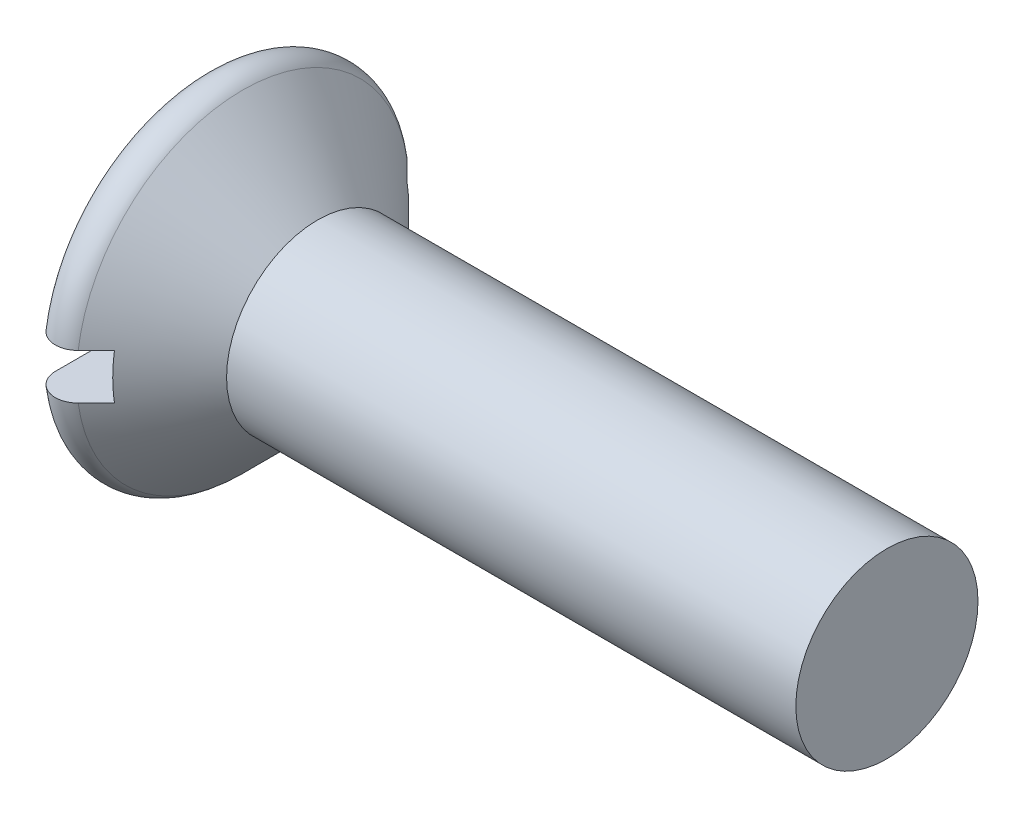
ISO-10303-21;
HEADER;
FILE_DESCRIPTION(('STEP AP214'),'2;1');
FILE_NAME('part.step','',(''),(''),'','','');
FILE_SCHEMA(('AUTOMOTIVE_DESIGN { 1 0 10303 214 1 1 1 1 }'));
ENDSEC;
DATA;
#1=APPLICATION_CONTEXT('core data for automotive mechanical design processes');
#2=APPLICATION_PROTOCOL_DEFINITION('international standard','automotive_design',2000,#1);
#3=PRODUCT_CONTEXT('',#1,'mechanical');
#4=PRODUCT('Part','Part','',(#3));
#5=PRODUCT_RELATED_PRODUCT_CATEGORY('part','',(#4));
#6=PRODUCT_DEFINITION_FORMATION('','',#4);
#7=PRODUCT_DEFINITION_CONTEXT('part definition',#1,'design');
#8=PRODUCT_DEFINITION('design','',#6,#7);
#9=PRODUCT_DEFINITION_SHAPE('','',#8);
#10=(LENGTH_UNIT() NAMED_UNIT(*) SI_UNIT(.MILLI.,.METRE.));
#11=(NAMED_UNIT(*) PLANE_ANGLE_UNIT() SI_UNIT($,.RADIAN.));
#12=(NAMED_UNIT(*) SI_UNIT($,.STERADIAN.) SOLID_ANGLE_UNIT());
#13=UNCERTAINTY_MEASURE_WITH_UNIT(LENGTH_MEASURE(1.E-05),#10,'distance_accuracy_value','');
#14=(GEOMETRIC_REPRESENTATION_CONTEXT(3) GLOBAL_UNCERTAINTY_ASSIGNED_CONTEXT((#13)) GLOBAL_UNIT_ASSIGNED_CONTEXT((#10,
#11,#12)) REPRESENTATION_CONTEXT('',''));
#15=CARTESIAN_POINT('',(0.,0.,0.));
#16=DIRECTION('',(0.,0.,1.));
#17=DIRECTION('',(1.,0.,0.));
#18=AXIS2_PLACEMENT_3D('',#15,#16,#17);
#19=CARTESIAN_POINT('',(0.,0.,0.));
#20=DIRECTION('',(1.,0.,0.));
#21=DIRECTION('',(0.,0.,-1.));
#22=AXIS2_PLACEMENT_3D('',#19,#20,#21);
#23=PLANE('',#22);
#24=CARTESIAN_POINT('',(0.,0.,0.));
#25=DIRECTION('',(1.,0.,0.));
#26=DIRECTION('',(0.,0.,-1.));
#27=AXIS2_PLACEMENT_3D('',#24,#25,#26);
#28=CIRCLE('',#27,1.31715728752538);
#29=CARTESIAN_POINT('',(0.,0.2,1.30188452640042));
#30=VERTEX_POINT('',#29);
#31=CARTESIAN_POINT('',(0.,0.2,-1.30188452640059));
#32=VERTEX_POINT('',#31);
#33=EDGE_CURVE('E171',#30,#32,#28,.F.);
#34=ORIENTED_EDGE('',*,*,#33,.T.);
#35=DIRECTION('',(0.,0.,1.));
#36=VECTOR('',#35,1.);
#37=CARTESIAN_POINT('',(0.,0.2,-1.51715728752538));
#38=LINE('',#37,#36);
#39=EDGE_CURVE('E108',#32,#30,#38,.T.);
#40=ORIENTED_EDGE('',*,*,#39,.T.);
#41=EDGE_LOOP('',(#34,#40));
#42=FACE_BOUND('',#41,.T.);
#43=ADVANCED_FACE('F30',(#42),#23,.F.);
#44=CARTESIAN_POINT('',(0.2,0.,0.));
#45=DIRECTION('',(1.,0.,0.));
#46=DIRECTION('',(0.,0.,-1.));
#47=AXIS2_PLACEMENT_3D('',#44,#45,#46);
#48=TOROIDAL_SURFACE('',#47,1.31715728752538,0.2);
#49=CARTESIAN_POINT('',(0.0611027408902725,0.2,-1.44730503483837));
#50=CARTESIAN_POINT('',(0.0691277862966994,0.2,-1.45512396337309));
#51=CARTESIAN_POINT('',(0.0778146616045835,0.2,-1.4622746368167));
#52=CARTESIAN_POINT('',(0.0962711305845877,0.2,-1.47502423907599));
#53=CARTESIAN_POINT('',(0.106041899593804,0.2,-1.48062145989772));
#54=CARTESIAN_POINT('',(0.126385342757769,0.2,-1.49009158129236));
#55=CARTESIAN_POINT('',(0.136957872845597,0.2,-1.49396479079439));
#56=CARTESIAN_POINT('',(0.158602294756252,0.2,-1.49987116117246));
#57=CARTESIAN_POINT('',(0.169674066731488,0.2,-1.5019047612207));
#58=CARTESIAN_POINT('',(0.191953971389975,0.2,-1.50406815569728));
#59=CARTESIAN_POINT('',(0.203161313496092,0.2,-1.50420609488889));
#60=CARTESIAN_POINT('',(0.225439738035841,0.2,-1.50259498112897));
#61=CARTESIAN_POINT('',(0.236510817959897,0.2,-1.50084589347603));
#62=CARTESIAN_POINT('',(0.258183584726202,0.2,-1.49551715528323));
#63=CARTESIAN_POINT('',(0.268786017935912,0.2,-1.49194053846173));
#64=CARTESIAN_POINT('',(0.28924275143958,0.2,-1.48306384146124));
#65=CARTESIAN_POINT('',(0.299097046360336,0.2,-1.47776374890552));
#66=CARTESIAN_POINT('',(0.317815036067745,0.2,-1.46557423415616));
#67=CARTESIAN_POINT('',(0.326675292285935,0.2,-1.45867953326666));
#68=CARTESIAN_POINT('',(0.343123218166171,0.2,-1.44351063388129));
#69=CARTESIAN_POINT('',(0.350710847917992,0.2,-1.43523639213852));
#70=CARTESIAN_POINT('',(0.36446051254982,0.2,-1.41747797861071));
#71=CARTESIAN_POINT('',(0.370611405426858,0.2,-1.40798518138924));
#72=CARTESIAN_POINT('',(0.381249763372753,0.2,-1.38810942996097));
#73=CARTESIAN_POINT('',(0.385737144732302,0.2,-1.37772643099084));
#74=CARTESIAN_POINT('',(0.392966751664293,0.2,-1.35625819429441));
#75=CARTESIAN_POINT('',(0.395691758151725,0.2,-1.34516715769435));
#76=CARTESIAN_POINT('',(0.399258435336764,0.2,-1.32268627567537));
#77=CARTESIAN_POINT('',(0.400100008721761,0.2,-1.31129641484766));
#78=CARTESIAN_POINT('',(0.399880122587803,0.2,-1.2884378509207));
#79=CARTESIAN_POINT('',(0.398802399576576,0.2,-1.27696930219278));
#80=CARTESIAN_POINT('',(0.39474402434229,0.2,-1.25437371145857));
#81=CARTESIAN_POINT('',(0.391763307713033,0.2,-1.24324668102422));
#82=CARTESIAN_POINT('',(0.383966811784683,0.2,-1.22161150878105));
#83=CARTESIAN_POINT('',(0.379144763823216,0.2,-1.2111056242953));
#84=CARTESIAN_POINT('',(0.367797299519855,0.2,-1.19105746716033));
#85=CARTESIAN_POINT('',(0.361271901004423,0.2,-1.18151518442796));
#86=CARTESIAN_POINT('',(0.346731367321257,0.2,-1.16371857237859));
#87=CARTESIAN_POINT('',(0.338723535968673,0.2,-1.15545827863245));
#88=CARTESIAN_POINT('',(0.32141912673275,0.2,-1.14042013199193));
#89=CARTESIAN_POINT('',(0.312122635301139,0.2,-1.13364217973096));
#90=CARTESIAN_POINT('',(0.292628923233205,0.2,-1.12185500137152));
#91=CARTESIAN_POINT('',(0.282444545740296,0.2,-1.11682453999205));
#92=CARTESIAN_POINT('',(0.261367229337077,0.2,-1.10857367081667));
#93=CARTESIAN_POINT('',(0.250474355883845,0.2,-1.10535309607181));
#94=CARTESIAN_POINT('',(0.228458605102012,0.2,-1.10085873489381));
#95=CARTESIAN_POINT('',(0.217341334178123,0.2,-1.09955746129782));
#96=CARTESIAN_POINT('',(0.195047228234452,0.2,-1.09885540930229));
#97=CARTESIAN_POINT('',(0.183870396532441,0.2,-1.09945452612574));
#98=CARTESIAN_POINT('',(0.161861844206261,0.2,-1.10252225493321));
#99=CARTESIAN_POINT('',(0.151028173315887,0.2,-1.10497691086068));
#100=CARTESIAN_POINT('',(0.129923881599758,0.2,-1.11166232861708));
#101=CARTESIAN_POINT('',(0.119653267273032,0.2,-1.11589311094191));
#102=CARTESIAN_POINT('',(0.0999138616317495,0.2,-1.12602430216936));
#103=CARTESIAN_POINT('',(0.0904488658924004,0.2,-1.13193210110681));
#104=CARTESIAN_POINT('',(0.072628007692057,0.2,-1.14523326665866));
#105=CARTESIAN_POINT('',(0.0642722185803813,0.2,-1.1526267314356));
#106=CARTESIAN_POINT('',(0.0487877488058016,0.2,-1.16879304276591));
#107=CARTESIAN_POINT('',(0.0416768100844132,0.2,-1.17758288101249));
#108=CARTESIAN_POINT('',(0.0290072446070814,0.2,-1.19621788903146));
#109=CARTESIAN_POINT('',(0.0234487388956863,0.2,-1.20606314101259));
#110=CARTESIAN_POINT('',(0.0139634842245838,0.2,-1.22667737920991));
#111=CARTESIAN_POINT('',(0.0100605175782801,0.2,-1.23745731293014));
#112=CARTESIAN_POINT('',(0.00410443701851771,0.2,-1.25951636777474));
#113=CARTESIAN_POINT('',(0.00205134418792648,0.2,-1.27079549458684));
#114=CARTESIAN_POINT('',(-0.000156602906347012,0.2,-1.29362326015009));
#115=CARTESIAN_POINT('',(-0.000297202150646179,0.2,-1.30517328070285));
#116=CARTESIAN_POINT('',(0.00136454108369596,0.2,-1.32813609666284));
#117=CARTESIAN_POINT('',(0.00316737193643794,0.2,-1.33954885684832));
#118=CARTESIAN_POINT('',(0.00866943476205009,0.2,-1.36190103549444));
#119=CARTESIAN_POINT('',(0.012367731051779,0.2,-1.3728406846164));
#120=CARTESIAN_POINT('',(0.0215602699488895,0.2,-1.3939269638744));
#121=CARTESIAN_POINT('',(0.0270522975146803,0.2,-1.40407455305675));
#122=CARTESIAN_POINT('',(0.0373599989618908,0.2,-1.41976176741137));
#123=CARTESIAN_POINT('',(0.0416871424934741,0.2,-1.42562825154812));
#124=CARTESIAN_POINT('',(0.0509505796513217,0.2,-1.43685893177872));
#125=CARTESIAN_POINT('',(0.0558868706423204,0.2,-1.44222313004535));
#126=CARTESIAN_POINT('',(0.0611027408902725,0.2,-1.44730503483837));
#127=B_SPLINE_CURVE_WITH_KNOTS('',3,(#49,#50,#51,#52,#53,#54,#55,#56,#57,#58,#59,#60,#61,#62,
#63,#64,#65,#66,#67,#68,#69,#70,#71,#72,#73,#74,#75,#76,#77,#78,#79,#80,#81,#82,#83,#84,#85,#86,
#87,#88,#89,#90,#91,#92,#93,#94,#95,#96,#97,#98,#99,#100,#101,#102,#103,#104,#105,#106,#107,
#108,#109,#110,#111,#112,#113,#114,#115,#116,#117,#118,#119,#120,#121,#122,#123,#124,#125,#126),
.UNSPECIFIED.,.T.,.F.,(4,2,2,2,2,2,2,2,2,2,2,2,2,2,2,2,2,2,2,2,2,2,2,2,2,2,2,2,2,2,2,2,2,2,2,2,
2,2,4),(0.,0.0335866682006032,0.0672101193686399,0.10082754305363,0.134436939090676,
0.167901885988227,0.201367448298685,0.234777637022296,0.268188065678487,0.301710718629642,
0.33523442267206,0.369010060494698,0.402787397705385,0.436889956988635,0.470994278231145,
0.505388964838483,0.539784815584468,0.574298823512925,0.608812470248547,0.643160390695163,
0.677506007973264,0.711418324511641,0.745327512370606,0.778746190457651,0.812163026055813,
0.845330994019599,0.87849934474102,0.911816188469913,0.945135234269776,0.978896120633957,
1.01265963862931,1.0468929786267,1.08112670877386,1.11561546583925,1.15011289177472,
1.18459330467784,1.21903129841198,1.24086101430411,1.26269063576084),.UNSPECIFIED.);
#128=CARTESIAN_POINT('',(0.341421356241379,0.2,-1.44480159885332));
#129=VERTEX_POINT('',#128);
#130=EDGE_CURVE('E54',#32,#129,#127,.T.);
#131=ORIENTED_EDGE('',*,*,#130,.F.);
#132=ORIENTED_EDGE('',*,*,#33,.F.);
#133=CARTESIAN_POINT('',(0.118933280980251,0.2,1.11655266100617));
#134=CARTESIAN_POINT('',(0.129038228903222,0.2,1.11200144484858));
#135=CARTESIAN_POINT('',(0.139531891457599,0.2,1.10829500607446));
#136=CARTESIAN_POINT('',(0.161000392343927,0.2,1.10269258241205));
#137=CARTESIAN_POINT('',(0.171975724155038,0.2,1.10079850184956));
#138=CARTESIAN_POINT('',(0.194087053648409,0.2,1.0988852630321));
#139=CARTESIAN_POINT('',(0.205223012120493,0.2,1.09886565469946));
#140=CARTESIAN_POINT('',(0.22733646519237,0.2,1.1007013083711));
#141=CARTESIAN_POINT('',(0.23831399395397,0.2,1.10255615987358));
#142=CARTESIAN_POINT('',(0.259779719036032,0.2,1.10807558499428));
#143=CARTESIAN_POINT('',(0.270268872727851,0.2,1.11173643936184));
#144=CARTESIAN_POINT('',(0.290491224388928,0.2,1.12075339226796));
#145=CARTESIAN_POINT('',(0.300224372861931,0.2,1.12610960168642));
#146=CARTESIAN_POINT('',(0.318745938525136,0.2,1.13840698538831));
#147=CARTESIAN_POINT('',(0.327526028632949,0.2,1.14536069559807));
#148=CARTESIAN_POINT('',(0.343815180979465,0.2,1.1606242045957));
#149=CARTESIAN_POINT('',(0.35132415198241,0.2,1.16893410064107));
#150=CARTESIAN_POINT('',(0.3649729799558,0.2,1.18680268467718));
#151=CARTESIAN_POINT('',(0.371091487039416,0.2,1.19637768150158));
#152=CARTESIAN_POINT('',(0.381657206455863,0.2,1.21640920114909));
#153=CARTESIAN_POINT('',(0.386104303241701,0.2,1.2268657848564));
#154=CARTESIAN_POINT('',(0.393254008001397,0.2,1.24850295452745));
#155=CARTESIAN_POINT('',(0.39593441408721,0.2,1.25969088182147));
#156=CARTESIAN_POINT('',(0.399388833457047,0.2,1.28235748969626));
#157=CARTESIAN_POINT('',(0.400162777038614,0.2,1.29383618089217));
#158=CARTESIAN_POINT('',(0.399779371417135,0.2,1.31681545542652));
#159=CARTESIAN_POINT('',(0.398612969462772,0.2,1.32831588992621));
#160=CARTESIAN_POINT('',(0.39435919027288,0.2,1.35095611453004));
#161=CARTESIAN_POINT('',(0.391271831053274,0.2,1.36209590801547));
#162=CARTESIAN_POINT('',(0.383271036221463,0.2,1.38365522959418));
#163=CARTESIAN_POINT('',(0.378364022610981,0.2,1.39407713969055));
#164=CARTESIAN_POINT('',(0.366855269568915,0.2,1.41393926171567));
#165=CARTESIAN_POINT('',(0.360253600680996,0.2,1.42337951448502));
#166=CARTESIAN_POINT('',(0.345602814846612,0.2,1.44092249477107));
#167=CARTESIAN_POINT('',(0.337566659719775,0.2,1.44903604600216));
#168=CARTESIAN_POINT('',(0.320234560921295,0.2,1.46378269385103));
#169=CARTESIAN_POINT('',(0.310938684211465,0.2,1.47041586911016));
#170=CARTESIAN_POINT('',(0.291447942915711,0.2,1.48194623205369));
#171=CARTESIAN_POINT('',(0.281262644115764,0.2,1.48685959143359));
#172=CARTESIAN_POINT('',(0.260207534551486,0.2,1.49489203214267));
#173=CARTESIAN_POINT('',(0.249337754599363,0.2,1.49801119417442));
#174=CARTESIAN_POINT('',(0.227308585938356,0.2,1.50234532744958));
#175=CARTESIAN_POINT('',(0.216151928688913,0.2,1.50357419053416));
#176=CARTESIAN_POINT('',(0.193791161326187,0.2,1.50413504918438));
#177=CARTESIAN_POINT('',(0.18258705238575,0.2,1.50346709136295));
#178=CARTESIAN_POINT('',(0.160485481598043,0.2,1.50025929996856));
#179=CARTESIAN_POINT('',(0.1495871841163,0.2,1.49772521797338));
#180=CARTESIAN_POINT('',(0.128369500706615,0.2,1.49086678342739));
#181=CARTESIAN_POINT('',(0.118050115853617,0.2,1.48654242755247));
#182=CARTESIAN_POINT('',(0.0982599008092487,0.2,1.47622026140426));
#183=CARTESIAN_POINT('',(0.0887907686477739,0.2,1.4702191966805));
#184=CARTESIAN_POINT('',(0.0709861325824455,0.2,1.45672208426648));
#185=CARTESIAN_POINT('',(0.0626506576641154,0.2,1.44922599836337));
#186=CARTESIAN_POINT('',(0.0472905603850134,0.2,1.43290135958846));
#187=CARTESIAN_POINT('',(0.0402747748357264,0.2,1.4240644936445));
#188=CARTESIAN_POINT('',(0.0278102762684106,0.2,1.40534740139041));
#189=CARTESIAN_POINT('',(0.0223616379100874,0.2,1.39546712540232));
#190=CARTESIAN_POINT('',(0.0131317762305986,0.2,1.37484572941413));
#191=CARTESIAN_POINT('',(0.00936653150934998,0.2,1.36409745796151));
#192=CARTESIAN_POINT('',(0.00367552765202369,0.2,1.34212451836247));
#193=CARTESIAN_POINT('',(0.00174986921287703,0.2,1.33089982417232));
#194=CARTESIAN_POINT('',(-0.000223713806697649,0.2,1.30818183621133));
#195=CARTESIAN_POINT('',(-0.000254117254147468,0.2,1.29668701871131));
#196=CARTESIAN_POINT('',(0.00160431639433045,0.2,1.27385382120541));
#197=CARTESIAN_POINT('',(0.00349316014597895,0.2,1.26251544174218));
#198=CARTESIAN_POINT('',(0.00915200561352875,0.2,1.24025517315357));
#199=CARTESIAN_POINT('',(0.0129317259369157,0.2,1.22933575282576));
#200=CARTESIAN_POINT('',(0.0222757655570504,0.2,1.20828520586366));
#201=CARTESIAN_POINT('',(0.0278405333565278,0.2,1.19815427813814));
#202=CARTESIAN_POINT('',(0.0405904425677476,0.2,1.1789961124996));
#203=CARTESIAN_POINT('',(0.0477726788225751,0.2,1.1699669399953));
#204=CARTESIAN_POINT('',(0.063561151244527,0.2,1.15326755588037));
#205=CARTESIAN_POINT('',(0.0721655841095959,0.2,1.14559564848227));
#206=CARTESIAN_POINT('',(0.0871907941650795,0.2,1.1343531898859));
#207=CARTESIAN_POINT('',(0.0932622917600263,0.2,1.13030772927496));
#208=CARTESIAN_POINT('',(0.105810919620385,0.2,1.12290395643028));
#209=CARTESIAN_POINT('',(0.112288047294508,0.2,1.11954563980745));
#210=CARTESIAN_POINT('',(0.118933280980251,0.2,1.11655266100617));
#211=B_SPLINE_CURVE_WITH_KNOTS('',3,(#133,#134,#135,#136,#137,#138,#139,#140,#141,#142,#143,
#144,#145,#146,#147,#148,#149,#150,#151,#152,#153,#154,#155,#156,#157,#158,#159,#160,#161,#162,
#163,#164,#165,#166,#167,#168,#169,#170,#171,#172,#173,#174,#175,#176,#177,#178,#179,#180,#181,
#182,#183,#184,#185,#186,#187,#188,#189,#190,#191,#192,#193,#194,#195,#196,#197,#198,#199,#200,
#201,#202,#203,#204,#205,#206,#207,#208,#209,#210),.UNSPECIFIED.,.T.,.F.,(4,2,2,2,2,2,2,2,2,2,2,
2,2,2,2,2,2,2,2,2,2,2,2,2,2,2,2,2,2,2,2,2,2,2,2,2,2,2,4),(0.,0.0332213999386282,
0.0664776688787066,0.0997259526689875,0.132966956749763,0.166139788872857,0.19931479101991,
0.232759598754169,0.266206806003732,0.30013728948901,0.334070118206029,0.368421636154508,
0.402774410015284,0.437287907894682,0.471801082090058,0.506193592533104,0.540584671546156,
0.574679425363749,0.608772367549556,0.642535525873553,0.676297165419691,0.709809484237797,
0.743320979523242,0.776729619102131,0.810138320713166,0.843612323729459,0.877087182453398,
0.91077878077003,0.944471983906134,0.978478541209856,1.0124869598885,1.04680973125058,
1.08113262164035,1.1156337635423,1.15014358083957,1.18459190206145,1.21899687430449,
1.24084412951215,1.26269124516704),.UNSPECIFIED.);
#212=CARTESIAN_POINT('',(0.341421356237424,0.2,1.44480159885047));
#213=VERTEX_POINT('',#212);
#214=EDGE_CURVE('E140',#213,#30,#211,.T.);
#215=ORIENTED_EDGE('',*,*,#214,.F.);
#216=CARTESIAN_POINT('',(0.341421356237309,0.,0.));
#217=DIRECTION('',(1.,0.,0.));
#218=DIRECTION('',(0.,0.,-1.));
#219=AXIS2_PLACEMENT_3D('',#216,#217,#218);
#220=CIRCLE('',#219,1.45857864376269);
#221=EDGE_CURVE('E173',#129,#213,#220,.T.);
#222=ORIENTED_EDGE('',*,*,#221,.F.);
#223=EDGE_LOOP('',(#131,#132,#215,#222));
#224=FACE_BOUND('',#223,.T.);
#225=ADVANCED_FACE('F153',(#224),#48,.T.);
#226=CARTESIAN_POINT('',(0.,-0.2,-1.30188452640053));
#227=VERTEX_POINT('',#226);
#228=CARTESIAN_POINT('',(0.,-0.2,1.30188452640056));
#229=VERTEX_POINT('',#228);
#230=EDGE_CURVE('E169',#227,#229,#28,.F.);
#231=ORIENTED_EDGE('',*,*,#230,.T.);
#232=DIRECTION('',(0.,0.,1.));
#233=VECTOR('',#232,1.);
#234=CARTESIAN_POINT('',(0.,-0.2,-1.51715728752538));
#235=LINE('',#234,#233);
#236=EDGE_CURVE('E46',#227,#229,#235,.T.);
#237=ORIENTED_EDGE('',*,*,#236,.F.);
#238=EDGE_LOOP('',(#231,#237));
#239=FACE_BOUND('',#238,.T.);
#240=ADVANCED_FACE('F155',(#239),#23,.F.);
#241=CARTESIAN_POINT('',(1.,0.,0.));
#242=DIRECTION('',(-1.,0.,0.));
#243=DIRECTION('',(0.,0.,1.));
#244=AXIS2_PLACEMENT_3D('',#241,#242,#243);
#245=CONICAL_SURFACE('',#244,0.8,0.785398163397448);
#246=CARTESIAN_POINT('',(0.5,0.,0.));
#247=DIRECTION('',(1.,0.,0.));
#248=DIRECTION('',(0.,0.,-1.));
#249=AXIS2_PLACEMENT_3D('',#246,#247,#248);
#250=CIRCLE('',#249,1.3);
#251=CARTESIAN_POINT('',(0.5,-0.2,-1.28452325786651));
#252=VERTEX_POINT('',#251);
#253=CARTESIAN_POINT('',(0.5,0.2,-1.28452325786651));
#254=VERTEX_POINT('',#253);
#255=EDGE_CURVE('E11',#252,#254,#250,.T.);
#256=ORIENTED_EDGE('',*,*,#255,.T.);
#257=CARTESIAN_POINT('',(-1.41165724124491,0.2,3.2054238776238));
#258=CARTESIAN_POINT('',(-1.30311801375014,0.2,3.09667193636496));
#259=CARTESIAN_POINT('',(-1.19458797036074,0.2,2.98791082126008));
#260=CARTESIAN_POINT('',(-0.977556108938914,0.2,2.77035691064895));
#261=CARTESIAN_POINT('',(-0.869054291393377,0.2,2.66156411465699));
#262=CARTESIAN_POINT('',(-0.652052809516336,0.2,2.44389746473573));
#263=CARTESIAN_POINT('',(-0.54355316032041,0.2,2.33502359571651));
#264=CARTESIAN_POINT('',(-0.326618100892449,0.2,2.11721529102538));
#265=CARTESIAN_POINT('',(-0.218182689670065,0.2,2.0082808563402));
#266=CARTESIAN_POINT('',(0.00296125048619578,0.2,1.78591402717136));
#267=CARTESIAN_POINT('',(0.115665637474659,0.2,1.67247751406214));
#268=CARTESIAN_POINT('',(0.34089125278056,0.2,1.4454119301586));
#269=CARTESIAN_POINT('',(0.45341247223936,0.2,1.3317828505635));
#270=CARTESIAN_POINT('',(0.621879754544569,0.2,1.16105516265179));
#271=CARTESIAN_POINT('',(0.677976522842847,0.2,1.1041052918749));
#272=CARTESIAN_POINT('',(0.79001146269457,0.2,0.990047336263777));
#273=CARTESIAN_POINT('',(0.845949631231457,0.2,0.932939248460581));
#274=CARTESIAN_POINT('',(0.957550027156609,0.2,0.818464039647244));
#275=CARTESIAN_POINT('',(1.01321227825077,0.2,0.761096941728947));
#276=CARTESIAN_POINT('',(1.12404562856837,0.2,0.645890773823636));
#277=CARTESIAN_POINT('',(1.17921674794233,0.2,0.588051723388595));
#278=CARTESIAN_POINT('',(1.24846005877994,0.2,0.514028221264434));
#279=CARTESIAN_POINT('',(1.26305978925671,0.2,0.498338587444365));
#280=CARTESIAN_POINT('',(1.29214521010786,0.2,0.466853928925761));
#281=CARTESIAN_POINT('',(1.30663089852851,0.2,0.451058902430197));
#282=CARTESIAN_POINT('',(1.34976323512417,0.2,0.40359923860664));
#283=CARTESIAN_POINT('',(1.37819890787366,0.2,0.371739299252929));
#284=CARTESIAN_POINT('',(1.42455576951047,0.2,0.317922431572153));
#285=CARTESIAN_POINT('',(1.44279551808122,0.2,0.296240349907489));
#286=CARTESIAN_POINT('',(1.4785443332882,0.2,0.25201112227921));
#287=CARTESIAN_POINT('',(1.4960473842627,0.2,0.229458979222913));
#288=CARTESIAN_POINT('',(1.52113138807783,0.2,0.194507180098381));
#289=CARTESIAN_POINT('',(1.52935592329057,0.2,0.182573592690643));
#290=CARTESIAN_POINT('',(1.54513753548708,0.2,0.158244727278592));
#291=CARTESIAN_POINT('',(1.55269376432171,0.2,0.145848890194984));
#292=CARTESIAN_POINT('',(1.56668354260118,0.2,0.120605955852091));
#293=CARTESIAN_POINT('',(1.57312867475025,0.2,0.107765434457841));
#294=CARTESIAN_POINT('',(1.58439751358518,0.2,0.0813987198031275));
#295=CARTESIAN_POINT('',(1.58922535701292,0.2,0.0678743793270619));
#296=CARTESIAN_POINT('',(1.59624706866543,0.2,0.0409091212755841));
#297=CARTESIAN_POINT('',(1.59857083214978,0.2,0.027504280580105));
#298=CARTESIAN_POINT('',(1.60044808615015,0.2,0.000528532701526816));
#299=CARTESIAN_POINT('',(1.60001036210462,0.2,-0.0130417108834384));
#300=CARTESIAN_POINT('',(1.59652552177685,0.2,-0.0397150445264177));
#301=CARTESIAN_POINT('',(1.59349723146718,0.2,-0.0528207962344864));
#302=CARTESIAN_POINT('',(1.58550665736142,0.2,-0.0784717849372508));
#303=CARTESIAN_POINT('',(1.58053386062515,0.2,-0.0910135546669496));
#304=CARTESIAN_POINT('',(1.56941297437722,0.2,-0.11525783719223));
#305=CARTESIAN_POINT('',(1.5632888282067,0.2,-0.126971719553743));
#306=CARTESIAN_POINT('',(1.55021595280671,0.2,-0.149935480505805));
#307=CARTESIAN_POINT('',(1.54326643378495,0.2,-0.161184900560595));
#308=CARTESIAN_POINT('',(1.52155236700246,0.2,-0.19447547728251));
#309=CARTESIAN_POINT('',(1.505966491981,0.2,-0.215974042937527));
#310=CARTESIAN_POINT('',(1.47356523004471,0.2,-0.25834737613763));
#311=CARTESIAN_POINT('',(1.45673876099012,0.2,-0.279213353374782));
#312=CARTESIAN_POINT('',(1.42249750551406,0.2,-0.320370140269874));
#313=CARTESIAN_POINT('',(1.40508424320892,0.2,-0.340662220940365));
#314=CARTESIAN_POINT('',(1.35303891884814,0.2,-0.400181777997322));
#315=CARTESIAN_POINT('',(1.31787842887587,0.2,-0.438943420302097));
#316=CARTESIAN_POINT('',(1.2469070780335,0.2,-0.515870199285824));
#317=CARTESIAN_POINT('',(1.21109611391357,0.2,-0.554035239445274));
#318=CARTESIAN_POINT('',(1.13906614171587,0.2,-0.630065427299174));
#319=CARTESIAN_POINT('',(1.10284669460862,0.2,-0.667930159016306));
#320=CARTESIAN_POINT('',(1.03019065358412,0.2,-0.743444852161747));
#321=CARTESIAN_POINT('',(0.993754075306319,0.2,-0.781094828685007));
#322=CARTESIAN_POINT('',(0.884991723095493,0.2,-0.893061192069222));
#323=CARTESIAN_POINT('',(0.812461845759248,0.2,-0.967179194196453));
#324=CARTESIAN_POINT('',(0.667169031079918,0.2,-1.11511887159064));
#325=CARTESIAN_POINT('',(0.594406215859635,0.2,-1.18894066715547));
#326=CARTESIAN_POINT('',(0.36241835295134,0.2,-1.42383336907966));
#327=CARTESIAN_POINT('',(0.202914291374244,0.2,-1.58462862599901));
#328=CARTESIAN_POINT('',(-0.11638127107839,0.2,-1.90599455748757));
#329=CARTESIAN_POINT('',(-0.276172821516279,0.2,-2.06656518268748));
#330=CARTESIAN_POINT('',(-0.598551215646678,0.2,-2.39024483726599));
#331=CARTESIAN_POINT('',(-0.761140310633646,0.2,-2.55335162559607));
#332=CARTESIAN_POINT('',(-1.08636786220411,0.2,-2.87945108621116));
#333=CARTESIAN_POINT('',(-1.24900630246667,0.2,-3.04244377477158));
#334=CARTESIAN_POINT('',(-1.41165724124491,0.2,-3.2054238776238));
#335=B_SPLINE_CURVE_WITH_KNOTS('',3,(#257,#258,#259,#260,#261,#262,#263,#264,#265,#266,#267,
#268,#269,#270,#271,#272,#273,#274,#275,#276,#277,#278,#279,#280,#281,#282,#283,#284,#285,#286,
#287,#288,#289,#290,#291,#292,#293,#294,#295,#296,#297,#298,#299,#300,#301,#302,#303,#304,#305,
#306,#307,#308,#309,#310,#311,#312,#313,#314,#315,#316,#317,#318,#319,#320,#321,#322,#323,#324,
#325,#326,#327,#328,#329,#330,#331,#332,#333,#334),.UNSPECIFIED.,.F.,.F.,(4,2,2,2,2,2,2,2,2,2,2,
2,2,2,2,2,2,2,2,2,2,2,2,2,2,2,2,2,2,2,2,2,2,2,2,2,2,2,4),(0.,0.460944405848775,
0.921896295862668,1.38301583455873,1.8441280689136,2.3238478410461,2.80359016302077,
3.04340501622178,3.2832244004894,3.52302281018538,3.76281133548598,3.82710569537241,
3.89140115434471,4.01949447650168,4.10448842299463,4.19007794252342,4.23354298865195,
4.27706242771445,4.32009643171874,4.36301950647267,4.40358934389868,4.44403017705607,
4.48417959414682,4.5245491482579,4.56415708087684,4.60380322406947,4.683381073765,
4.763784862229,4.84399385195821,5.00097302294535,5.15797733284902,5.31517050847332,
5.47235249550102,5.78345601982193,6.09441688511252,6.7738785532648,7.45347144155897,
8.14437753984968,8.83514578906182),.UNSPECIFIED.);
#336=EDGE_CURVE('E106',#254,#129,#335,.T.);
#337=ORIENTED_EDGE('',*,*,#336,.T.);
#338=ORIENTED_EDGE('',*,*,#221,.T.);
#339=CARTESIAN_POINT('',(0.5,0.2,1.28452325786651));
#340=VERTEX_POINT('',#339);
#341=EDGE_CURVE('E103',#213,#340,#335,.T.);
#342=ORIENTED_EDGE('',*,*,#341,.T.);
#343=CARTESIAN_POINT('',(0.5,-0.2,1.28452325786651));
#344=VERTEX_POINT('',#343);
#345=EDGE_CURVE('E35',#340,#344,#250,.T.);
#346=ORIENTED_EDGE('',*,*,#345,.T.);
#347=CARTESIAN_POINT('',(-1.41165724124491,-0.2,-3.2054238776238));
#348=CARTESIAN_POINT('',(-1.30311801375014,-0.2,-3.09667193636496));
#349=CARTESIAN_POINT('',(-1.19458797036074,-0.2,-2.98791082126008));
#350=CARTESIAN_POINT('',(-0.977556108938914,-0.2,-2.77035691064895));
#351=CARTESIAN_POINT('',(-0.869054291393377,-0.2,-2.66156411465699));
#352=CARTESIAN_POINT('',(-0.652052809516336,-0.2,-2.44389746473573));
#353=CARTESIAN_POINT('',(-0.54355316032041,-0.2,-2.33502359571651));
#354=CARTESIAN_POINT('',(-0.326618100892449,-0.2,-2.11721529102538));
#355=CARTESIAN_POINT('',(-0.218182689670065,-0.2,-2.0082808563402));
#356=CARTESIAN_POINT('',(0.00296125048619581,-0.2,-1.78591402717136));
#357=CARTESIAN_POINT('',(0.115665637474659,-0.2,-1.67247751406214));
#358=CARTESIAN_POINT('',(0.34089125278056,-0.2,-1.4454119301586));
#359=CARTESIAN_POINT('',(0.45341247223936,-0.2,-1.3317828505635));
#360=CARTESIAN_POINT('',(0.621879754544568,-0.2,-1.16105516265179));
#361=CARTESIAN_POINT('',(0.677976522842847,-0.2,-1.1041052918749));
#362=CARTESIAN_POINT('',(0.790011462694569,-0.2,-0.990047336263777));
#363=CARTESIAN_POINT('',(0.845949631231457,-0.2,-0.932939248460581));
#364=CARTESIAN_POINT('',(0.957550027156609,-0.2,-0.818464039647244));
#365=CARTESIAN_POINT('',(1.01321227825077,-0.2,-0.761096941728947));
#366=CARTESIAN_POINT('',(1.12404562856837,-0.2,-0.645890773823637));
#367=CARTESIAN_POINT('',(1.17921674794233,-0.2,-0.588051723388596));
#368=CARTESIAN_POINT('',(1.24846005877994,-0.2,-0.514028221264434));
#369=CARTESIAN_POINT('',(1.26305978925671,-0.2,-0.498338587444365));
#370=CARTESIAN_POINT('',(1.29214521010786,-0.2,-0.466853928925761));
#371=CARTESIAN_POINT('',(1.30663089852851,-0.2,-0.451058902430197));
#372=CARTESIAN_POINT('',(1.34976323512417,-0.2,-0.40359923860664));
#373=CARTESIAN_POINT('',(1.37819890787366,-0.2,-0.371739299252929));
#374=CARTESIAN_POINT('',(1.42455576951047,-0.2,-0.317922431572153));
#375=CARTESIAN_POINT('',(1.44279551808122,-0.2,-0.296240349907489));
#376=CARTESIAN_POINT('',(1.4785443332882,-0.2,-0.25201112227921));
#377=CARTESIAN_POINT('',(1.4960473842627,-0.2,-0.229458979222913));
#378=CARTESIAN_POINT('',(1.52113138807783,-0.2,-0.194507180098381));
#379=CARTESIAN_POINT('',(1.52935592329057,-0.2,-0.182573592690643));
#380=CARTESIAN_POINT('',(1.54513753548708,-0.2,-0.158244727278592));
#381=CARTESIAN_POINT('',(1.55269376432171,-0.2,-0.145848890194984));
#382=CARTESIAN_POINT('',(1.56668354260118,-0.2,-0.120605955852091));
#383=CARTESIAN_POINT('',(1.57312867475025,-0.2,-0.107765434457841));
#384=CARTESIAN_POINT('',(1.58439751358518,-0.2,-0.0813987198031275));
#385=CARTESIAN_POINT('',(1.58922535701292,-0.2,-0.0678743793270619));
#386=CARTESIAN_POINT('',(1.59624706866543,-0.2,-0.0409091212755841));
#387=CARTESIAN_POINT('',(1.59857083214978,-0.2,-0.027504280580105));
#388=CARTESIAN_POINT('',(1.60044808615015,-0.2,-0.000528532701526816));
#389=CARTESIAN_POINT('',(1.60001036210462,-0.2,0.0130417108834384));
#390=CARTESIAN_POINT('',(1.59652552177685,-0.2,0.0397150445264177));
#391=CARTESIAN_POINT('',(1.59349723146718,-0.2,0.0528207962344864));
#392=CARTESIAN_POINT('',(1.58550665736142,-0.2,0.0784717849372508));
#393=CARTESIAN_POINT('',(1.58053386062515,-0.2,0.0910135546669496));
#394=CARTESIAN_POINT('',(1.56941297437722,-0.2,0.11525783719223));
#395=CARTESIAN_POINT('',(1.5632888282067,-0.2,0.126971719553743));
#396=CARTESIAN_POINT('',(1.55021595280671,-0.2,0.149935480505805));
#397=CARTESIAN_POINT('',(1.54326643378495,-0.2,0.161184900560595));
#398=CARTESIAN_POINT('',(1.52155236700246,-0.2,0.19447547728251));
#399=CARTESIAN_POINT('',(1.505966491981,-0.2,0.215974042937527));
#400=CARTESIAN_POINT('',(1.47356523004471,-0.2,0.25834737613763));
#401=CARTESIAN_POINT('',(1.45673876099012,-0.2,0.279213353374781));
#402=CARTESIAN_POINT('',(1.42249750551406,-0.2,0.320370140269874));
#403=CARTESIAN_POINT('',(1.40508424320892,-0.2,0.340662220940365));
#404=CARTESIAN_POINT('',(1.35303891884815,-0.2,0.400181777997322));
#405=CARTESIAN_POINT('',(1.31787842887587,-0.2,0.438943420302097));
#406=CARTESIAN_POINT('',(1.2469070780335,-0.2,0.515870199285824));
#407=CARTESIAN_POINT('',(1.21109611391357,-0.2,0.554035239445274));
#408=CARTESIAN_POINT('',(1.13906614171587,-0.2,0.630065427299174));
#409=CARTESIAN_POINT('',(1.10284669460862,-0.2,0.667930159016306));
#410=CARTESIAN_POINT('',(1.03019065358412,-0.2,0.743444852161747));
#411=CARTESIAN_POINT('',(0.993754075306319,-0.2,0.781094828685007));
#412=CARTESIAN_POINT('',(0.884991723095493,-0.2,0.893061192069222));
#413=CARTESIAN_POINT('',(0.812461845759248,-0.2,0.967179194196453));
#414=CARTESIAN_POINT('',(0.667169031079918,-0.2,1.11511887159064));
#415=CARTESIAN_POINT('',(0.594406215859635,-0.2,1.18894066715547));
#416=CARTESIAN_POINT('',(0.36241835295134,-0.2,1.42383336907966));
#417=CARTESIAN_POINT('',(0.202914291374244,-0.2,1.58462862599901));
#418=CARTESIAN_POINT('',(-0.11638127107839,-0.2,1.90599455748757));
#419=CARTESIAN_POINT('',(-0.276172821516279,-0.2,2.06656518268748));
#420=CARTESIAN_POINT('',(-0.598551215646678,-0.2,2.39024483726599));
#421=CARTESIAN_POINT('',(-0.761140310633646,-0.2,2.55335162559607));
#422=CARTESIAN_POINT('',(-1.08636786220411,-0.2,2.87945108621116));
#423=CARTESIAN_POINT('',(-1.24900630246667,-0.2,3.04244377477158));
#424=CARTESIAN_POINT('',(-1.41165724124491,-0.2,3.2054238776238));
#425=B_SPLINE_CURVE_WITH_KNOTS('',3,(#347,#348,#349,#350,#351,#352,#353,#354,#355,#356,#357,
#358,#359,#360,#361,#362,#363,#364,#365,#366,#367,#368,#369,#370,#371,#372,#373,#374,#375,#376,
#377,#378,#379,#380,#381,#382,#383,#384,#385,#386,#387,#388,#389,#390,#391,#392,#393,#394,#395,
#396,#397,#398,#399,#400,#401,#402,#403,#404,#405,#406,#407,#408,#409,#410,#411,#412,#413,#414,
#415,#416,#417,#418,#419,#420,#421,#422,#423,#424),.UNSPECIFIED.,.F.,.F.,(4,2,2,2,2,2,2,2,2,2,2,
2,2,2,2,2,2,2,2,2,2,2,2,2,2,2,2,2,2,2,2,2,2,2,2,2,2,2,4),(0.,0.460944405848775,
0.921896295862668,1.38301583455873,1.8441280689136,2.3238478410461,2.80359016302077,
3.04340501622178,3.2832244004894,3.52302281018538,3.76281133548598,3.82710569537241,
3.89140115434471,4.01949447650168,4.10448842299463,4.19007794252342,4.23354298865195,
4.27706242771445,4.32009643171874,4.36301950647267,4.40358934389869,4.44403017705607,
4.48417959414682,4.5245491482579,4.56415708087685,4.60380322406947,4.683381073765,
4.763784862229,4.84399385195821,5.00097302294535,5.15797733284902,5.31517050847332,
5.47235249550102,5.78345601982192,6.09441688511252,6.7738785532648,7.45347144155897,
8.14437753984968,8.83514578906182),.UNSPECIFIED.);
#426=CARTESIAN_POINT('',(0.341421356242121,-0.2,1.44480159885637));
#427=VERTEX_POINT('',#426);
#428=EDGE_CURVE('E96',#344,#427,#425,.T.);
#429=ORIENTED_EDGE('',*,*,#428,.T.);
#430=CARTESIAN_POINT('',(0.341421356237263,-0.2,-1.44480159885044));
#431=VERTEX_POINT('',#430);
#432=EDGE_CURVE('E102',#427,#431,#220,.T.);
#433=ORIENTED_EDGE('',*,*,#432,.T.);
#434=EDGE_CURVE('E93',#431,#252,#425,.T.);
#435=ORIENTED_EDGE('',*,*,#434,.T.);
#436=EDGE_LOOP('',(#256,#337,#338,#342,#346,#429,#433,#435));
#437=FACE_BOUND('',#436,.T.);
#438=CARTESIAN_POINT('',(1.,0.,0.));
#439=DIRECTION('',(-1.,0.,0.));
#440=DIRECTION('',(0.,0.,1.));
#441=AXIS2_PLACEMENT_3D('',#438,#439,#440);
#442=CIRCLE('',#441,0.8);
#443=CARTESIAN_POINT('',(1.,0.,0.8));
#444=VERTEX_POINT('',#443);
#445=EDGE_CURVE('E174',#444,#444,#442,.T.);
#446=ORIENTED_EDGE('',*,*,#445,.T.);
#447=EDGE_LOOP('',(#446));
#448=FACE_BOUND('',#447,.T.);
#449=ADVANCED_FACE('F99',(#437,#448),#245,.T.);
#450=CARTESIAN_POINT('',(-5.56964084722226,0.,0.));
#451=DIRECTION('',(-1.,0.,0.));
#452=DIRECTION('',(0.,0.,1.));
#453=AXIS2_PLACEMENT_3D('',#450,#451,#452);
#454=CYLINDRICAL_SURFACE('',#453,0.8);
#455=ORIENTED_EDGE('',*,*,#445,.F.);
#456=EDGE_LOOP('',(#455));
#457=FACE_BOUND('',#456,.T.);
#458=CARTESIAN_POINT('',(6.00000000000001,0.,0.));
#459=DIRECTION('',(-1.,0.,0.));
#460=DIRECTION('',(0.,0.,1.));
#461=AXIS2_PLACEMENT_3D('',#458,#459,#460);
#462=CIRCLE('',#461,0.8);
#463=CARTESIAN_POINT('',(6.00000000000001,0.,0.8));
#464=VERTEX_POINT('',#463);
#465=EDGE_CURVE('E189',#464,#464,#462,.T.);
#466=ORIENTED_EDGE('',*,*,#465,.T.);
#467=EDGE_LOOP('',(#466));
#468=FACE_BOUND('',#467,.T.);
#469=ADVANCED_FACE('F166',(#457,#468),#454,.T.);
#470=CARTESIAN_POINT('',(6.00000000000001,0.8,0.));
#471=DIRECTION('',(-1.,0.,0.));
#472=DIRECTION('',(0.,0.,1.));
#473=AXIS2_PLACEMENT_3D('',#470,#471,#472);
#474=PLANE('',#473);
#475=ORIENTED_EDGE('',*,*,#465,.F.);
#476=EDGE_LOOP('',(#475));
#477=FACE_BOUND('',#476,.T.);
#478=ADVANCED_FACE('F127',(#477),#474,.F.);
#479=CARTESIAN_POINT('',(0.0611027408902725,-0.2,-1.44730503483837));
#480=CARTESIAN_POINT('',(0.0529698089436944,-0.2,-1.43937957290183));
#481=CARTESIAN_POINT('',(0.0455049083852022,-0.2,-1.43075598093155));
#482=CARTESIAN_POINT('',(0.0321268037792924,-0.2,-1.41236779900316));
#483=CARTESIAN_POINT('',(0.0262156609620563,-0.2,-1.40260171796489));
#484=CARTESIAN_POINT('',(0.0161174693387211,-0.2,-1.3822257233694));
#485=CARTESIAN_POINT('',(0.0119288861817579,-0.2,-1.37161657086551));
#486=CARTESIAN_POINT('',(0.00537971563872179,-0.2,-1.34985202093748));
#487=CARTESIAN_POINT('',(0.00301867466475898,-0.2,-1.33869675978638));
#488=CARTESIAN_POINT('',(0.000171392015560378,-0.2,-1.31606954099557));
#489=CARTESIAN_POINT('',(-0.000301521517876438,-0.2,-1.30459590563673));
#490=CARTESIAN_POINT('',(0.000673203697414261,-0.2,-1.28172983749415));
#491=CARTESIAN_POINT('',(0.00212100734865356,-0.2,-1.27033741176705));
#492=CARTESIAN_POINT('',(0.006910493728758,-0.2,-1.2478865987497));
#493=CARTESIAN_POINT('',(0.0102633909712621,-0.2,-1.2368306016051));
#494=CARTESIAN_POINT('',(0.0187797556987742,-0.2,-1.21543901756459));
#495=CARTESIAN_POINT('',(0.0239432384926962,-0.2,-1.20510343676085));
#496=CARTESIAN_POINT('',(0.0359330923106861,-0.2,-1.18546389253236));
#497=CARTESIAN_POINT('',(0.0427573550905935,-0.2,-1.17615864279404));
#498=CARTESIAN_POINT('',(0.0578855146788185,-0.2,-1.15884010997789));
#499=CARTESIAN_POINT('',(0.0661893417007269,-0.2,-1.15082676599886));
#500=CARTESIAN_POINT('',(0.0839562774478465,-0.2,-1.13640804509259));
#501=CARTESIAN_POINT('',(0.093407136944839,-0.2,-1.12998758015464));
#502=CARTESIAN_POINT('',(0.113265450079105,-0.2,-1.11885227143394));
#503=CARTESIAN_POINT('',(0.123672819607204,-0.2,-1.11413727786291));
#504=CARTESIAN_POINT('',(0.144983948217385,-0.2,-1.10661971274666));
#505=CARTESIAN_POINT('',(0.155878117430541,-0.2,-1.10378995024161));
#506=CARTESIAN_POINT('',(0.177988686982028,-0.2,-1.10002292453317));
#507=CARTESIAN_POINT('',(0.189205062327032,-0.2,-1.09908551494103));
#508=CARTESIAN_POINT('',(0.211507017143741,-0.2,-1.09913293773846));
#509=CARTESIAN_POINT('',(0.222592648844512,-0.2,-1.10009626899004));
#510=CARTESIAN_POINT('',(0.244444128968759,-0.2,-1.10387163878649));
#511=CARTESIAN_POINT('',(0.255209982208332,-0.2,-1.10668364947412));
#512=CARTESIAN_POINT('',(0.276114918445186,-0.2,-1.11406690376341));
#513=CARTESIAN_POINT('',(0.286254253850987,-0.2,-1.11863743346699));
#514=CARTESIAN_POINT('',(0.305632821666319,-0.2,-1.12939866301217));
#515=CARTESIAN_POINT('',(0.314872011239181,-0.2,-1.13558943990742));
#516=CARTESIAN_POINT('',(0.332294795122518,-0.2,-1.14948210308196));
#517=CARTESIAN_POINT('',(0.340466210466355,-0.2,-1.1571992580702));
#518=CARTESIAN_POINT('',(0.355420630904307,-0.2,-1.17387820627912));
#519=CARTESIAN_POINT('',(0.362203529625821,-0.2,-1.18284009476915));
#520=CARTESIAN_POINT('',(0.374292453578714,-0.2,-1.20189564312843));
#521=CARTESIAN_POINT('',(0.379575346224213,-0.2,-1.2120039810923));
#522=CARTESIAN_POINT('',(0.388389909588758,-0.2,-1.23295742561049));
#523=CARTESIAN_POINT('',(0.391921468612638,-0.2,-1.24380257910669));
#524=CARTESIAN_POINT('',(0.397167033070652,-0.2,-1.26604653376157));
#525=CARTESIAN_POINT('',(0.398861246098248,-0.2,-1.27745000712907));
#526=CARTESIAN_POINT('',(0.400316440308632,-0.2,-1.30037988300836));
#527=CARTESIAN_POINT('',(0.400077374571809,-0.2,-1.31190628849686));
#528=CARTESIAN_POINT('',(0.397665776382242,-0.2,-1.33478346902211));
#529=CARTESIAN_POINT('',(0.395488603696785,-0.2,-1.34613375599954));
#530=CARTESIAN_POINT('',(0.389249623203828,-0.2,-1.36830425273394));
#531=CARTESIAN_POINT('',(0.385187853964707,-0.2,-1.37912447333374));
#532=CARTESIAN_POINT('',(0.375314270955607,-0.2,-1.39986562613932));
#533=CARTESIAN_POINT('',(0.369511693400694,-0.2,-1.40979095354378));
#534=CARTESIAN_POINT('',(0.356307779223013,-0.2,-1.42851444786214));
#535=CARTESIAN_POINT('',(0.34890651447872,-0.2,-1.43731266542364));
#536=CARTESIAN_POINT('',(0.332788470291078,-0.2,-1.45344453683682));
#537=CARTESIAN_POINT('',(0.324084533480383,-0.2,-1.4607910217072));
#538=CARTESIAN_POINT('',(0.30555697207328,-0.2,-1.47390192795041));
#539=CARTESIAN_POINT('',(0.295733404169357,-0.2,-1.4796664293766));
#540=CARTESIAN_POINT('',(0.275344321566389,-0.2,-1.48939414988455));
#541=CARTESIAN_POINT('',(0.264786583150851,-0.2,-1.4933736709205));
#542=CARTESIAN_POINT('',(0.243150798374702,-0.2,-1.49949065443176));
#543=CARTESIAN_POINT('',(0.232072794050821,-0.2,-1.50162826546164));
#544=CARTESIAN_POINT('',(0.209787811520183,-0.2,-1.50398989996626));
#545=CARTESIAN_POINT('',(0.19858214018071,-0.2,-1.50422627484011));
#546=CARTESIAN_POINT('',(0.176287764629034,-0.2,-1.50281051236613));
#547=CARTESIAN_POINT('',(0.165199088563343,-0.2,-1.50115793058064));
#548=CARTESIAN_POINT('',(0.143472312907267,-0.2,-1.49601696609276));
#549=CARTESIAN_POINT('',(0.132833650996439,-0.2,-1.49253095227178));
#550=CARTESIAN_POINT('',(0.112299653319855,-0.2,-1.4838293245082));
#551=CARTESIAN_POINT('',(0.102403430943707,-0.2,-1.47861581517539));
#552=CARTESIAN_POINT('',(0.087284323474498,-0.2,-1.46895694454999));
#553=CARTESIAN_POINT('',(0.0817416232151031,-0.2,-1.46500234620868));
#554=CARTESIAN_POINT('',(0.0710869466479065,-0.2,-1.45655035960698));
#555=CARTESIAN_POINT('',(0.0659749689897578,-0.2,-1.45205297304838));
#556=CARTESIAN_POINT('',(0.0611027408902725,-0.2,-1.44730503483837));
#557=B_SPLINE_CURVE_WITH_KNOTS('',3,(#479,#480,#481,#482,#483,#484,#485,#486,#487,#488,#489,
#490,#491,#492,#493,#494,#495,#496,#497,#498,#499,#500,#501,#502,#503,#504,#505,#506,#507,#508,
#509,#510,#511,#512,#513,#514,#515,#516,#517,#518,#519,#520,#521,#522,#523,#524,#525,#526,#527,
#528,#529,#530,#531,#532,#533,#534,#535,#536,#537,#538,#539,#540,#541,#542,#543,#544,#545,#546,
#547,#548,#549,#550,#551,#552,#553,#554,#555,#556),.UNSPECIFIED.,.T.,.F.,(4,2,2,2,2,2,2,2,2,2,2,
2,2,2,2,2,2,2,2,2,2,2,2,2,2,2,2,2,2,2,2,2,2,2,2,2,2,2,4),(0.,0.0340427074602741,
0.0681303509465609,0.102187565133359,0.136236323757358,0.170525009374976,0.2048166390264,
0.239312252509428,0.273808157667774,0.308260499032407,0.342711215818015,0.37682195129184,
0.410929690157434,0.444534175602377,0.478136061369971,0.511360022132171,0.544583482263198,
0.577793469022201,0.611005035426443,0.644567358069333,0.678132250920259,0.712189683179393,
0.746249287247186,0.780672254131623,0.815096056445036,0.849602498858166,0.884108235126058,
0.918434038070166,0.952758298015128,0.986764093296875,1.02076816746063,1.05445502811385,
1.08813917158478,1.12160430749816,1.15507731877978,1.18850718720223,1.22189647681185,
1.2422906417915,1.26268474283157),.UNSPECIFIED.);
#558=EDGE_CURVE('E136',#431,#227,#557,.T.);
#559=ORIENTED_EDGE('',*,*,#558,.F.);
#560=ORIENTED_EDGE('',*,*,#432,.F.);
#561=CARTESIAN_POINT('',(0.118933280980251,-0.2,1.11655266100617));
#562=CARTESIAN_POINT('',(0.108647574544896,-0.2,1.12118642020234));
#563=CARTESIAN_POINT('',(0.0987495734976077,-0.2,1.12670244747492));
#564=CARTESIAN_POINT('',(0.0800164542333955,-0.2,1.13932897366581));
#565=CARTESIAN_POINT('',(0.0711828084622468,-0.2,1.14644164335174));
#566=CARTESIAN_POINT('',(0.0548390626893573,-0.2,1.16203656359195));
#567=CARTESIAN_POINT('',(0.0473275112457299,-0.2,1.17051729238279));
#568=CARTESIAN_POINT('',(0.0338192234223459,-0.2,1.18860523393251));
#569=CARTESIAN_POINT('',(0.0278221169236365,-0.2,1.19821217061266));
#570=CARTESIAN_POINT('',(0.0174420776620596,-0.2,1.21839070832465));
#571=CARTESIAN_POINT('',(0.0130768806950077,-0.2,1.22897143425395));
#572=CARTESIAN_POINT('',(0.00616711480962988,-0.2,1.25071219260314));
#573=CARTESIAN_POINT('',(0.00362272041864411,-0.2,1.26187228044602));
#574=CARTESIAN_POINT('',(0.000410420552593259,-0.2,1.28455809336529));
#575=CARTESIAN_POINT('',(-0.00024109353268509,-0.2,1.29608614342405));
#576=CARTESIAN_POINT('',(0.000399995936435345,-0.2,1.31908830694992));
#577=CARTESIAN_POINT('',(0.00169261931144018,-0.2,1.33056241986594));
#578=CARTESIAN_POINT('',(0.00619119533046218,-0.2,1.35313089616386));
#579=CARTESIAN_POINT('',(0.00939734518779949,-0.2,1.36422522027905));
#580=CARTESIAN_POINT('',(0.0176391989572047,-0.2,1.38571236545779));
#581=CARTESIAN_POINT('',(0.0226748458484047,-0.2,1.39610520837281));
#582=CARTESIAN_POINT('',(0.0343989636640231,-0.2,1.4158181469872));
#583=CARTESIAN_POINT('',(0.0410760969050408,-0.2,1.42514498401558));
#584=CARTESIAN_POINT('',(0.0559155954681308,-0.2,1.44253125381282));
#585=CARTESIAN_POINT('',(0.0640778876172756,-0.2,1.45059074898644));
#586=CARTESIAN_POINT('',(0.0815714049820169,-0.2,1.46513051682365));
#587=CARTESIAN_POINT('',(0.0908905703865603,-0.2,1.47162529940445));
#588=CARTESIAN_POINT('',(0.110494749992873,-0.2,1.48294178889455));
#589=CARTESIAN_POINT('',(0.120779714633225,-0.2,1.48776358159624));
#590=CARTESIAN_POINT('',(0.14192603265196,-0.2,1.4955544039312));
#591=CARTESIAN_POINT('',(0.15278152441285,-0.2,1.49853934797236));
#592=CARTESIAN_POINT('',(0.174840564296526,-0.2,1.50263362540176));
#593=CARTESIAN_POINT('',(0.186044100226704,-0.2,1.50374302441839));
#594=CARTESIAN_POINT('',(0.20841838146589,-0.2,1.50405223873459));
#595=CARTESIAN_POINT('',(0.219588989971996,-0.2,1.50326205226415));
#596=CARTESIAN_POINT('',(0.241638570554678,-0.2,1.49981651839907));
#597=CARTESIAN_POINT('',(0.252517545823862,-0.2,1.49716119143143));
#598=CARTESIAN_POINT('',(0.273671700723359,-0.2,1.49006547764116));
#599=CARTESIAN_POINT('',(0.283947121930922,-0.2,1.48562581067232));
#600=CARTESIAN_POINT('',(0.303611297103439,-0.2,1.47509181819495));
#601=CARTESIAN_POINT('',(0.313000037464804,-0.2,1.46899746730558));
#602=CARTESIAN_POINT('',(0.330671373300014,-0.2,1.45530014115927));
#603=CARTESIAN_POINT('',(0.338948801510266,-0.2,1.44769050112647));
#604=CARTESIAN_POINT('',(0.354121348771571,-0.2,1.43119973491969));
#605=CARTESIAN_POINT('',(0.361016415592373,-0.2,1.42231856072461));
#606=CARTESIAN_POINT('',(0.373290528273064,-0.2,1.40345914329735));
#607=CARTESIAN_POINT('',(0.378656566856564,-0.2,1.39347243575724));
#608=CARTESIAN_POINT('',(0.387654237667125,-0.2,1.37274622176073));
#609=CARTESIAN_POINT('',(0.391285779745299,-0.2,1.36200667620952));
#610=CARTESIAN_POINT('',(0.39674781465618,-0.2,1.33996827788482));
#611=CARTESIAN_POINT('',(0.398560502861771,-0.2,1.32866501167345));
#612=CARTESIAN_POINT('',(0.400278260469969,-0.2,1.30591438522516));
#613=CARTESIAN_POINT('',(0.400183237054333,-0.2,1.29446701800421));
#614=CARTESIAN_POINT('',(0.398083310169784,-0.2,1.27166029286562));
#615=CARTESIAN_POINT('',(0.396063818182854,-0.2,1.26030227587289));
#616=CARTESIAN_POINT('',(0.390150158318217,-0.2,1.23808486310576));
#617=CARTESIAN_POINT('',(0.386255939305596,-0.2,1.22722548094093));
#618=CARTESIAN_POINT('',(0.376690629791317,-0.2,1.20629782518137));
#619=CARTESIAN_POINT('',(0.371016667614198,-0.2,1.19623086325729));
#620=CARTESIAN_POINT('',(0.358048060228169,-0.2,1.17720083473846));
#621=CARTESIAN_POINT('',(0.350753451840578,-0.2,1.16823774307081));
#622=CARTESIAN_POINT('',(0.334800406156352,-0.2,1.15174094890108));
#623=CARTESIAN_POINT('',(0.326151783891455,-0.2,1.14419775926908));
#624=CARTESIAN_POINT('',(0.307696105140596,-0.2,1.13069503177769));
#625=CARTESIAN_POINT('',(0.297889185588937,-0.2,1.1247353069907));
#626=CARTESIAN_POINT('',(0.277540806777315,-0.2,1.11465791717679));
#627=CARTESIAN_POINT('',(0.267011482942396,-0.2,1.11051574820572));
#628=CARTESIAN_POINT('',(0.245398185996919,-0.2,1.10408456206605));
#629=CARTESIAN_POINT('',(0.234314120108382,-0.2,1.10179585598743));
#630=CARTESIAN_POINT('',(0.212065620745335,-0.2,1.09916414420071));
#631=CARTESIAN_POINT('',(0.200904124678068,-0.2,1.09879613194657));
#632=CARTESIAN_POINT('',(0.178689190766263,-0.2,1.09995112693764));
#633=CARTESIAN_POINT('',(0.167635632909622,-0.2,1.10147171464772));
#634=CARTESIAN_POINT('',(0.150292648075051,-0.2,1.10537021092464));
#635=CARTESIAN_POINT('',(0.143865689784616,-0.2,1.10716212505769));
#636=CARTESIAN_POINT('',(0.131225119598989,-0.2,1.11138421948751));
#637=CARTESIAN_POINT('',(0.12501150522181,-0.2,1.11381439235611));
#638=CARTESIAN_POINT('',(0.118933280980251,-0.2,1.11655266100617));
#639=B_SPLINE_CURVE_WITH_KNOTS('',3,(#561,#562,#563,#564,#565,#566,#567,#568,#569,#570,#571,
#572,#573,#574,#575,#576,#577,#578,#579,#580,#581,#582,#583,#584,#585,#586,#587,#588,#589,#590,
#591,#592,#593,#594,#595,#596,#597,#598,#599,#600,#601,#602,#603,#604,#605,#606,#607,#608,#609,
#610,#611,#612,#613,#614,#615,#616,#617,#618,#619,#620,#621,#622,#623,#624,#625,#626,#627,#628,
#629,#630,#631,#632,#633,#634,#635,#636,#637,#638),.UNSPECIFIED.,.T.,.F.,(4,2,2,2,2,2,2,2,2,2,2,
2,2,2,2,2,2,2,2,2,2,2,2,2,2,2,2,2,2,2,2,2,2,2,2,2,2,2,4),(0.,0.0338190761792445,
0.067684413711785,0.101512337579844,0.135331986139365,0.169509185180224,0.203689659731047,
0.238165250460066,0.272641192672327,0.307120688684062,0.341599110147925,0.375845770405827,
0.41009074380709,0.444004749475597,0.477917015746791,0.511531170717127,0.545144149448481,
0.578580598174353,0.612016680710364,0.645439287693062,0.678862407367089,0.712435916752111,
0.746010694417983,0.779863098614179,0.813717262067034,0.847899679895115,0.882083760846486,
0.916529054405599,0.950975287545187,0.985477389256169,1.01997870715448,1.05424061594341,
1.08849847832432,1.12227911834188,1.15606542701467,1.18941073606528,1.2227133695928,
1.24269861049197,1.26268361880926),.UNSPECIFIED.);
#640=EDGE_CURVE('E131',#229,#427,#639,.T.);
#641=ORIENTED_EDGE('',*,*,#640,.F.);
#642=ORIENTED_EDGE('',*,*,#230,.F.);
#643=EDGE_LOOP('',(#559,#560,#641,#642));
#644=FACE_BOUND('',#643,.T.);
#645=ADVANCED_FACE('F32',(#644),#48,.T.);
#646=CARTESIAN_POINT('',(0.5,0.2,-1.51715728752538));
#647=DIRECTION('',(1.,0.,0.));
#648=DIRECTION('',(0.,0.,-1.));
#649=AXIS2_PLACEMENT_3D('',#646,#647,#648);
#650=PLANE('',#649);
#651=DIRECTION('',(0.,0.,1.));
#652=VECTOR('',#651,1.);
#653=CARTESIAN_POINT('',(0.5,0.2,-1.51715728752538));
#654=LINE('',#653,#652);
#655=EDGE_CURVE('E89',#254,#340,#654,.T.);
#656=ORIENTED_EDGE('',*,*,#655,.F.);
#657=ORIENTED_EDGE('',*,*,#255,.F.);
#658=DIRECTION('',(0.,0.,1.));
#659=VECTOR('',#658,1.);
#660=CARTESIAN_POINT('',(0.5,-0.2,-1.51715728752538));
#661=LINE('',#660,#659);
#662=EDGE_CURVE('E86',#252,#344,#661,.T.);
#663=ORIENTED_EDGE('',*,*,#662,.T.);
#664=ORIENTED_EDGE('',*,*,#345,.F.);
#665=EDGE_LOOP('',(#656,#657,#663,#664));
#666=FACE_BOUND('',#665,.T.);
#667=ADVANCED_FACE('F85',(#666),#650,.F.);
#668=CARTESIAN_POINT('',(0.,0.2,-1.51715728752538));
#669=DIRECTION('',(0.,1.,0.));
#670=DIRECTION('',(0.,0.,1.));
#671=AXIS2_PLACEMENT_3D('',#668,#669,#670);
#672=PLANE('',#671);
#673=ORIENTED_EDGE('',*,*,#655,.T.);
#674=ORIENTED_EDGE('',*,*,#341,.F.);
#675=ORIENTED_EDGE('',*,*,#214,.T.);
#676=ORIENTED_EDGE('',*,*,#39,.F.);
#677=ORIENTED_EDGE('',*,*,#130,.T.);
#678=ORIENTED_EDGE('',*,*,#336,.F.);
#679=EDGE_LOOP('',(#673,#674,#675,#676,#677,#678));
#680=FACE_BOUND('',#679,.T.);
#681=ADVANCED_FACE('F126',(#680),#672,.F.);
#682=CARTESIAN_POINT('',(0.,-0.2,-1.51715728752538));
#683=DIRECTION('',(0.,-1.,0.));
#684=DIRECTION('',(0.,0.,-1.));
#685=AXIS2_PLACEMENT_3D('',#682,#683,#684);
#686=PLANE('',#685);
#687=ORIENTED_EDGE('',*,*,#558,.T.);
#688=ORIENTED_EDGE('',*,*,#236,.T.);
#689=ORIENTED_EDGE('',*,*,#640,.T.);
#690=ORIENTED_EDGE('',*,*,#428,.F.);
#691=ORIENTED_EDGE('',*,*,#662,.F.);
#692=ORIENTED_EDGE('',*,*,#434,.F.);
#693=EDGE_LOOP('',(#687,#688,#689,#690,#691,#692));
#694=FACE_BOUND('',#693,.T.);
#695=ADVANCED_FACE('F92',(#694),#686,.F.);
#696=CLOSED_SHELL('',(#43,#225,#240,#449,#469,#478,#645,#667,#681,#695));
#697=MANIFOLD_SOLID_BREP('B2',#696);
#698=ADVANCED_BREP_SHAPE_REPRESENTATION('',(#18,#697),#14);
#699=SHAPE_DEFINITION_REPRESENTATION(#9,#698);
ENDSEC;
END-ISO-10303-21;
